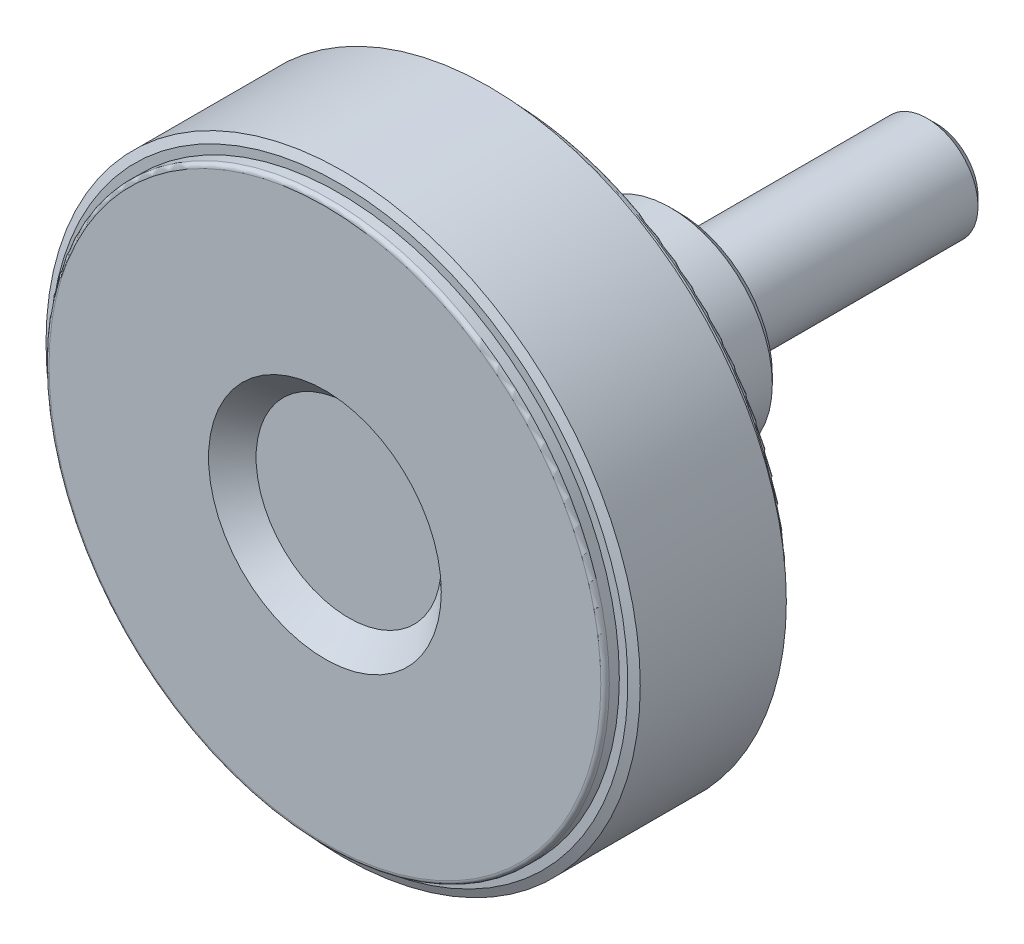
ISO-10303-21;
HEADER;
FILE_DESCRIPTION(('STEP AP214'),'2;1');
FILE_NAME('part.step','',(''),(''),'','','');
FILE_SCHEMA(('AUTOMOTIVE_DESIGN { 1 0 10303 214 1 1 1 1 }'));
ENDSEC;
DATA;
#1=APPLICATION_CONTEXT('core data for automotive mechanical design processes');
#2=APPLICATION_PROTOCOL_DEFINITION('international standard','automotive_design',2000,#1);
#3=PRODUCT_CONTEXT('',#1,'mechanical');
#4=PRODUCT('Part','Part','',(#3));
#5=PRODUCT_RELATED_PRODUCT_CATEGORY('part','',(#4));
#6=PRODUCT_DEFINITION_FORMATION('','',#4);
#7=PRODUCT_DEFINITION_CONTEXT('part definition',#1,'design');
#8=PRODUCT_DEFINITION('design','',#6,#7);
#9=PRODUCT_DEFINITION_SHAPE('','',#8);
#10=(LENGTH_UNIT() NAMED_UNIT(*) SI_UNIT(.MILLI.,.METRE.));
#11=(NAMED_UNIT(*) PLANE_ANGLE_UNIT() SI_UNIT($,.RADIAN.));
#12=(NAMED_UNIT(*) SI_UNIT($,.STERADIAN.) SOLID_ANGLE_UNIT());
#13=UNCERTAINTY_MEASURE_WITH_UNIT(LENGTH_MEASURE(1.E-05),#10,'distance_accuracy_value','');
#14=(GEOMETRIC_REPRESENTATION_CONTEXT(3) GLOBAL_UNCERTAINTY_ASSIGNED_CONTEXT((#13)) GLOBAL_UNIT_ASSIGNED_CONTEXT((#10,
#11,#12)) REPRESENTATION_CONTEXT('',''));
#15=CARTESIAN_POINT('',(0.,0.,0.));
#16=DIRECTION('',(0.,0.,1.));
#17=DIRECTION('',(1.,0.,0.));
#18=AXIS2_PLACEMENT_3D('',#15,#16,#17);
#19=CARTESIAN_POINT('',(0.,2.46325,-30.));
#20=DIRECTION('',(0.,0.,-1.));
#21=DIRECTION('',(-1.,0.,0.));
#22=AXIS2_PLACEMENT_3D('',#19,#20,#21);
#23=PLANE('',#22);
#24=CARTESIAN_POINT('',(0.,0.,-29.9999999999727));
#25=DIRECTION('',(0.,0.,1.));
#26=DIRECTION('',(1.,0.,0.));
#27=AXIS2_PLACEMENT_3D('',#24,#25,#26);
#28=CIRCLE('',#27,4.92650000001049);
#29=CARTESIAN_POINT('',(4.92650000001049,0.,-29.9999999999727));
#30=VERTEX_POINT('',#29);
#31=EDGE_CURVE('E179',#30,#30,#28,.T.);
#32=ORIENTED_EDGE('',*,*,#31,.F.);
#33=EDGE_LOOP('',(#32));
#34=FACE_BOUND('',#33,.T.);
#35=ADVANCED_FACE('F14',(#34),#23,.T.);
#36=CARTESIAN_POINT('',(0.,0.,-28.9265000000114));
#37=DIRECTION('',(0.,0.,1.));
#38=DIRECTION('',(1.,0.,0.));
#39=AXIS2_PLACEMENT_3D('',#36,#37,#38);
#40=CONICAL_SURFACE('',#39,5.99999999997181,0.785398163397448);
#41=ORIENTED_EDGE('',*,*,#31,.T.);
#42=EDGE_LOOP('',(#41));
#43=FACE_BOUND('',#42,.T.);
#44=CARTESIAN_POINT('',(0.,0.,-28.9265));
#45=DIRECTION('',(0.,0.,1.));
#46=DIRECTION('',(1.,0.,0.));
#47=AXIS2_PLACEMENT_3D('',#44,#45,#46);
#48=CIRCLE('',#47,6.);
#49=CARTESIAN_POINT('',(6.,0.,-28.9265));
#50=VERTEX_POINT('',#49);
#51=EDGE_CURVE('E176',#50,#50,#48,.T.);
#52=ORIENTED_EDGE('',*,*,#51,.F.);
#53=EDGE_LOOP('',(#52));
#54=FACE_BOUND('',#53,.T.);
#55=ADVANCED_FACE('F536',(#43,#54),#40,.T.);
#56=CARTESIAN_POINT('',(0.,0.,-13.96325));
#57=DIRECTION('',(0.,0.,1.));
#58=DIRECTION('',(1.,0.,0.));
#59=AXIS2_PLACEMENT_3D('',#56,#57,#58);
#60=CYLINDRICAL_SURFACE('',#59,6.);
#61=ORIENTED_EDGE('',*,*,#51,.T.);
#62=EDGE_LOOP('',(#61));
#63=FACE_BOUND('',#62,.T.);
#64=CARTESIAN_POINT('',(0.,0.,0.));
#65=DIRECTION('',(0.,0.,1.));
#66=DIRECTION('',(1.,0.,0.));
#67=AXIS2_PLACEMENT_3D('',#64,#65,#66);
#68=CIRCLE('',#67,6.);
#69=CARTESIAN_POINT('',(6.,0.,0.));
#70=VERTEX_POINT('',#69);
#71=EDGE_CURVE('E178',#70,#70,#68,.T.);
#72=ORIENTED_EDGE('',*,*,#71,.F.);
#73=EDGE_LOOP('',(#72));
#74=FACE_BOUND('',#73,.T.);
#75=ADVANCED_FACE('F526',(#63,#74),#60,.T.);
#76=CARTESIAN_POINT('',(0.,4.,0.));
#77=DIRECTION('',(0.,0.,-1.));
#78=DIRECTION('',(-1.,0.,0.));
#79=AXIS2_PLACEMENT_3D('',#76,#77,#78);
#80=PLANE('',#79);
#81=CARTESIAN_POINT('',(0.,0.,0.));
#82=DIRECTION('',(0.,0.,1.));
#83=DIRECTION('',(1.,0.,0.));
#84=AXIS2_PLACEMENT_3D('',#81,#82,#83);
#85=CIRCLE('',#84,8.);
#86=CARTESIAN_POINT('',(8.,0.,0.));
#87=VERTEX_POINT('',#86);
#88=EDGE_CURVE('E211',#87,#87,#85,.T.);
#89=ORIENTED_EDGE('',*,*,#88,.F.);
#90=EDGE_LOOP('',(#89));
#91=FACE_BOUND('',#90,.T.);
#92=ORIENTED_EDGE('',*,*,#71,.T.);
#93=EDGE_LOOP('',(#92));
#94=FACE_BOUND('',#93,.T.);
#95=ADVANCED_FACE('F516',(#91,#94),#80,.T.);
#96=CARTESIAN_POINT('',(0.,0.,0.15));
#97=DIRECTION('',(0.,0.,1.));
#98=DIRECTION('',(1.,0.,0.));
#99=AXIS2_PLACEMENT_3D('',#96,#97,#98);
#100=CYLINDRICAL_SURFACE('',#99,8.);
#101=ORIENTED_EDGE('',*,*,#88,.T.);
#102=EDGE_LOOP('',(#101));
#103=FACE_BOUND('',#102,.T.);
#104=CARTESIAN_POINT('',(0.,0.,0.3));
#105=DIRECTION('',(0.,0.,1.));
#106=DIRECTION('',(1.,0.,0.));
#107=AXIS2_PLACEMENT_3D('',#104,#105,#106);
#108=CIRCLE('',#107,8.);
#109=CARTESIAN_POINT('',(8.,0.,0.3));
#110=VERTEX_POINT('',#109);
#111=EDGE_CURVE('E208',#110,#110,#108,.T.);
#112=ORIENTED_EDGE('',*,*,#111,.F.);
#113=EDGE_LOOP('',(#112));
#114=FACE_BOUND('',#113,.T.);
#115=ADVANCED_FACE('F506',(#103,#114),#100,.T.);
#116=CARTESIAN_POINT('',(0.,9.5,0.3));
#117=DIRECTION('',(0.,0.,-1.));
#118=DIRECTION('',(-1.,0.,0.));
#119=AXIS2_PLACEMENT_3D('',#116,#117,#118);
#120=PLANE('',#119);
#121=CARTESIAN_POINT('',(0.,0.,0.3));
#122=DIRECTION('',(0.,0.,1.));
#123=DIRECTION('',(1.,0.,0.));
#124=AXIS2_PLACEMENT_3D('',#121,#122,#123);
#125=CIRCLE('',#124,11.);
#126=CARTESIAN_POINT('',(11.,0.,0.3));
#127=VERTEX_POINT('',#126);
#128=EDGE_CURVE('E175',#127,#127,#125,.T.);
#129=ORIENTED_EDGE('',*,*,#128,.F.);
#130=EDGE_LOOP('',(#129));
#131=FACE_BOUND('',#130,.T.);
#132=ORIENTED_EDGE('',*,*,#111,.T.);
#133=EDGE_LOOP('',(#132));
#134=FACE_BOUND('',#133,.T.);
#135=ADVANCED_FACE('F496',(#131,#134),#120,.T.);
#136=CARTESIAN_POINT('',(0.,0.,1.3));
#137=DIRECTION('',(0.,0.,1.));
#138=DIRECTION('',(1.,0.,0.));
#139=AXIS2_PLACEMENT_3D('',#136,#137,#138);
#140=CONICAL_SURFACE('',#139,12.,0.785398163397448);
#141=ORIENTED_EDGE('',*,*,#128,.T.);
#142=EDGE_LOOP('',(#141));
#143=FACE_BOUND('',#142,.T.);
#144=CARTESIAN_POINT('',(0.,0.,1.3));
#145=DIRECTION('',(0.,0.,1.));
#146=DIRECTION('',(1.,0.,0.));
#147=AXIS2_PLACEMENT_3D('',#144,#145,#146);
#148=CIRCLE('',#147,12.);
#149=CARTESIAN_POINT('',(12.,0.,1.3));
#150=VERTEX_POINT('',#149);
#151=EDGE_CURVE('E172',#150,#150,#148,.T.);
#152=ORIENTED_EDGE('',*,*,#151,.F.);
#153=EDGE_LOOP('',(#152));
#154=FACE_BOUND('',#153,.T.);
#155=ADVANCED_FACE('F487',(#143,#154),#140,.T.);
#156=CARTESIAN_POINT('',(0.,0.,17.65));
#157=DIRECTION('',(0.,0.,1.));
#158=DIRECTION('',(1.,0.,0.));
#159=AXIS2_PLACEMENT_3D('',#156,#157,#158);
#160=CYLINDRICAL_SURFACE('',#159,12.);
#161=ORIENTED_EDGE('',*,*,#151,.T.);
#162=EDGE_LOOP('',(#161));
#163=FACE_BOUND('',#162,.T.);
#164=CARTESIAN_POINT('',(0.,0.,34.));
#165=DIRECTION('',(0.,0.,-1.));
#166=DIRECTION('',(-1.,0.,0.));
#167=AXIS2_PLACEMENT_3D('',#164,#165,#166);
#168=CIRCLE('',#167,12.);
#169=CARTESIAN_POINT('',(-12.,0.,34.));
#170=VERTEX_POINT('',#169);
#171=EDGE_CURVE('E75',#170,#170,#168,.T.);
#172=ORIENTED_EDGE('',*,*,#171,.T.);
#173=EDGE_LOOP('',(#172));
#174=FACE_BOUND('',#173,.T.);
#175=ADVANCED_FACE('F482',(#163,#174),#160,.T.);
#176=CARTESIAN_POINT('',(0.,0.,34.));
#177=DIRECTION('',(0.,0.,-1.));
#178=DIRECTION('',(-1.,0.,0.));
#179=AXIS2_PLACEMENT_3D('',#176,#177,#178);
#180=TOROIDAL_SURFACE('',#179,13.,1.);
#181=CARTESIAN_POINT('',(0.,0.,35.));
#182=DIRECTION('',(0.,0.,-1.));
#183=DIRECTION('',(1.,0.,0.));
#184=AXIS2_PLACEMENT_3D('',#181,#182,#183);
#185=CIRCLE('',#184,13.);
#186=CARTESIAN_POINT('',(-13.,0.,35.));
#187=VERTEX_POINT('',#186);
#188=CARTESIAN_POINT('',(13.,0.,35.));
#189=VERTEX_POINT('',#188);
#190=EDGE_CURVE('E68',#187,#189,#185,.F.);
#191=ORIENTED_EDGE('',*,*,#190,.F.);
#192=CARTESIAN_POINT('',(0.,0.,35.));
#193=DIRECTION('',(0.,0.,-1.));
#194=DIRECTION('',(-1.,0.,0.));
#195=AXIS2_PLACEMENT_3D('',#192,#193,#194);
#196=CIRCLE('',#195,13.);
#197=CARTESIAN_POINT('',(0.,13.,35.));
#198=VERTEX_POINT('',#197);
#199=EDGE_CURVE('E71',#198,#187,#196,.F.);
#200=ORIENTED_EDGE('',*,*,#199,.F.);
#201=CARTESIAN_POINT('',(0.,0.,35.));
#202=DIRECTION('',(0.,0.,-1.));
#203=DIRECTION('',(0.,1.,0.));
#204=AXIS2_PLACEMENT_3D('',#201,#202,#203);
#205=CIRCLE('',#204,13.);
#206=EDGE_CURVE('E63',#189,#198,#205,.F.);
#207=ORIENTED_EDGE('',*,*,#206,.F.);
#208=EDGE_LOOP('',(#191,#200,#207));
#209=FACE_BOUND('',#208,.T.);
#210=ORIENTED_EDGE('',*,*,#171,.F.);
#211=EDGE_LOOP('',(#210));
#212=FACE_BOUND('',#211,.T.);
#213=ADVANCED_FACE('F66',(#209,#212),#180,.F.);
#214=CARTESIAN_POINT('',(0.,19.4615384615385,35.));
#215=DIRECTION('',(0.,0.,-1.));
#216=DIRECTION('',(-1.,0.,0.));
#217=AXIS2_PLACEMENT_3D('',#214,#215,#216);
#218=PLANE('',#217);
#219=CARTESIAN_POINT('',(0.,0.,35.));
#220=DIRECTION('',(0.,0.,1.));
#221=DIRECTION('',(-1.,0.,0.));
#222=AXIS2_PLACEMENT_3D('',#219,#220,#221);
#223=CIRCLE('',#222,25.9230769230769);
#224=CARTESIAN_POINT('',(25.9230769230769,0.,35.));
#225=VERTEX_POINT('',#224);
#226=CARTESIAN_POINT('',(-25.9230769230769,0.,35.));
#227=VERTEX_POINT('',#226);
#228=EDGE_CURVE('E81',#225,#227,#223,.F.);
#229=ORIENTED_EDGE('',*,*,#228,.T.);
#230=CARTESIAN_POINT('',(0.,0.,35.));
#231=DIRECTION('',(0.,0.,1.));
#232=DIRECTION('',(0.,1.,0.));
#233=AXIS2_PLACEMENT_3D('',#230,#231,#232);
#234=CIRCLE('',#233,25.9230769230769);
#235=CARTESIAN_POINT('',(0.,25.9230769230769,35.));
#236=VERTEX_POINT('',#235);
#237=EDGE_CURVE('E130',#227,#236,#234,.F.);
#238=ORIENTED_EDGE('',*,*,#237,.T.);
#239=CARTESIAN_POINT('',(0.,0.,35.));
#240=DIRECTION('',(0.,0.,1.));
#241=DIRECTION('',(1.,0.,0.));
#242=AXIS2_PLACEMENT_3D('',#239,#240,#241);
#243=CIRCLE('',#242,25.9230769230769);
#244=EDGE_CURVE('E143',#236,#225,#243,.F.);
#245=ORIENTED_EDGE('',*,*,#244,.T.);
#246=EDGE_LOOP('',(#229,#238,#245));
#247=FACE_BOUND('',#246,.T.);
#248=ORIENTED_EDGE('',*,*,#199,.T.);
#249=ORIENTED_EDGE('',*,*,#190,.T.);
#250=ORIENTED_EDGE('',*,*,#206,.T.);
#251=EDGE_LOOP('',(#248,#249,#250));
#252=FACE_BOUND('',#251,.T.);
#253=ADVANCED_FACE('F79',(#247,#252),#218,.T.);
#254=CARTESIAN_POINT('',(0.,0.,34.));
#255=DIRECTION('',(0.,0.,-1.));
#256=DIRECTION('',(-1.,0.,0.));
#257=AXIS2_PLACEMENT_3D('',#254,#255,#256);
#258=TOROIDAL_SURFACE('',#257,25.9230769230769,1.);
#259=ORIENTED_EDGE('',*,*,#237,.F.);
#260=ORIENTED_EDGE('',*,*,#228,.F.);
#261=ORIENTED_EDGE('',*,*,#244,.F.);
#262=EDGE_LOOP('',(#259,#260,#261));
#263=FACE_BOUND('',#262,.T.);
#264=CARTESIAN_POINT('',(0.,0.,34.));
#265=DIRECTION('',(0.,0.,1.));
#266=DIRECTION('',(1.,0.,0.));
#267=AXIS2_PLACEMENT_3D('',#264,#265,#266);
#268=CIRCLE('',#267,26.9230769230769);
#269=CARTESIAN_POINT('',(26.9230769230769,0.,34.));
#270=VERTEX_POINT('',#269);
#271=EDGE_CURVE('E205',#270,#270,#268,.F.);
#272=ORIENTED_EDGE('',*,*,#271,.T.);
#273=EDGE_LOOP('',(#272));
#274=FACE_BOUND('',#273,.T.);
#275=ADVANCED_FACE('F100',(#263,#274),#258,.F.);
#276=CARTESIAN_POINT('',(0.,0.,27.25));
#277=DIRECTION('',(0.,0.,1.));
#278=DIRECTION('',(1.,0.,0.));
#279=AXIS2_PLACEMENT_3D('',#276,#277,#278);
#280=CYLINDRICAL_SURFACE('',#279,26.9230769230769);
#281=ORIENTED_EDGE('',*,*,#271,.F.);
#282=EDGE_LOOP('',(#281));
#283=FACE_BOUND('',#282,.T.);
#284=CARTESIAN_POINT('',(0.,0.,20.5));
#285=DIRECTION('',(0.,0.,1.));
#286=DIRECTION('',(1.,0.,0.));
#287=AXIS2_PLACEMENT_3D('',#284,#285,#286);
#288=CIRCLE('',#287,26.9230769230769);
#289=CARTESIAN_POINT('',(26.9230769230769,0.,20.5));
#290=VERTEX_POINT('',#289);
#291=EDGE_CURVE('E201',#290,#290,#288,.T.);
#292=ORIENTED_EDGE('',*,*,#291,.F.);
#293=EDGE_LOOP('',(#292));
#294=FACE_BOUND('',#293,.T.);
#295=ADVANCED_FACE('F329',(#283,#294),#280,.F.);
#296=CARTESIAN_POINT('',(0.,29.7115384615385,20.5));
#297=DIRECTION('',(0.,0.,-1.));
#298=DIRECTION('',(-1.,0.,0.));
#299=AXIS2_PLACEMENT_3D('',#296,#297,#298);
#300=PLANE('',#299);
#301=CARTESIAN_POINT('',(0.,0.,20.5));
#302=DIRECTION('',(0.,0.,1.));
#303=DIRECTION('',(-1.,0.,0.));
#304=AXIS2_PLACEMENT_3D('',#301,#302,#303);
#305=CIRCLE('',#304,32.5);
#306=CARTESIAN_POINT('',(-32.5,0.,20.5));
#307=VERTEX_POINT('',#306);
#308=CARTESIAN_POINT('',(32.5,0.,20.5));
#309=VERTEX_POINT('',#308);
#310=EDGE_CURVE('E264',#307,#309,#305,.T.);
#311=ORIENTED_EDGE('',*,*,#310,.F.);
#312=CARTESIAN_POINT('',(0.,0.,20.5));
#313=DIRECTION('',(0.,0.,1.));
#314=DIRECTION('',(0.,1.,0.));
#315=AXIS2_PLACEMENT_3D('',#312,#313,#314);
#316=CIRCLE('',#315,32.5);
#317=CARTESIAN_POINT('',(0.,32.5,20.5));
#318=VERTEX_POINT('',#317);
#319=EDGE_CURVE('E299',#318,#307,#316,.T.);
#320=ORIENTED_EDGE('',*,*,#319,.F.);
#321=CARTESIAN_POINT('',(0.,0.,20.5));
#322=DIRECTION('',(0.,0.,1.));
#323=DIRECTION('',(1.,0.,0.));
#324=AXIS2_PLACEMENT_3D('',#321,#322,#323);
#325=CIRCLE('',#324,32.5);
#326=EDGE_CURVE('E204',#309,#318,#325,.T.);
#327=ORIENTED_EDGE('',*,*,#326,.F.);
#328=EDGE_LOOP('',(#311,#320,#327));
#329=FACE_BOUND('',#328,.T.);
#330=ORIENTED_EDGE('',*,*,#291,.T.);
#331=EDGE_LOOP('',(#330));
#332=FACE_BOUND('',#331,.T.);
#333=ADVANCED_FACE('F275',(#329,#332),#300,.T.);
#334=CARTESIAN_POINT('',(0.,0.,21.));
#335=DIRECTION('',(0.,0.,-1.));
#336=DIRECTION('',(-1.,0.,0.));
#337=AXIS2_PLACEMENT_3D('',#334,#335,#336);
#338=TOROIDAL_SURFACE('',#337,32.5,0.5);
#339=ORIENTED_EDGE('',*,*,#319,.T.);
#340=ORIENTED_EDGE('',*,*,#310,.T.);
#341=ORIENTED_EDGE('',*,*,#326,.T.);
#342=EDGE_LOOP('',(#339,#340,#341));
#343=FACE_BOUND('',#342,.T.);
#344=CARTESIAN_POINT('',(0.,0.,21.));
#345=DIRECTION('',(0.,0.,1.));
#346=DIRECTION('',(1.,0.,0.));
#347=AXIS2_PLACEMENT_3D('',#344,#345,#346);
#348=CIRCLE('',#347,33.);
#349=CARTESIAN_POINT('',(33.,0.,21.));
#350=VERTEX_POINT('',#349);
#351=EDGE_CURVE('E200',#350,#350,#348,.T.);
#352=ORIENTED_EDGE('',*,*,#351,.F.);
#353=EDGE_LOOP('',(#352));
#354=FACE_BOUND('',#353,.T.);
#355=ADVANCED_FACE('F269',(#343,#354),#338,.T.);
#356=CARTESIAN_POINT('',(0.,0.,21.59));
#357=DIRECTION('',(0.,0.,1.));
#358=DIRECTION('',(1.,0.,0.));
#359=AXIS2_PLACEMENT_3D('',#356,#357,#358);
#360=CYLINDRICAL_SURFACE('',#359,33.);
#361=ORIENTED_EDGE('',*,*,#351,.T.);
#362=EDGE_LOOP('',(#361));
#363=FACE_BOUND('',#362,.T.);
#364=CARTESIAN_POINT('',(0.,0.,22.18));
#365=DIRECTION('',(0.,0.,1.));
#366=DIRECTION('',(1.,0.,0.));
#367=AXIS2_PLACEMENT_3D('',#364,#365,#366);
#368=CIRCLE('',#367,33.);
#369=CARTESIAN_POINT('',(33.,0.,22.18));
#370=VERTEX_POINT('',#369);
#371=EDGE_CURVE('E197',#370,#370,#368,.T.);
#372=ORIENTED_EDGE('',*,*,#371,.F.);
#373=EDGE_LOOP('',(#372));
#374=FACE_BOUND('',#373,.T.);
#375=ADVANCED_FACE('F274',(#363,#374),#360,.T.);
#376=CARTESIAN_POINT('',(0.,33.5,22.18));
#377=DIRECTION('',(0.,0.,-1.));
#378=DIRECTION('',(-1.,0.,0.));
#379=AXIS2_PLACEMENT_3D('',#376,#377,#378);
#380=PLANE('',#379);
#381=CARTESIAN_POINT('',(0.,0.,22.18));
#382=DIRECTION('',(0.,0.,1.));
#383=DIRECTION('',(1.,0.,0.));
#384=AXIS2_PLACEMENT_3D('',#381,#382,#383);
#385=CIRCLE('',#384,34.);
#386=CARTESIAN_POINT('',(34.,0.,22.18));
#387=VERTEX_POINT('',#386);
#388=EDGE_CURVE('E193',#387,#387,#385,.T.);
#389=ORIENTED_EDGE('',*,*,#388,.F.);
#390=EDGE_LOOP('',(#389));
#391=FACE_BOUND('',#390,.T.);
#392=ORIENTED_EDGE('',*,*,#371,.T.);
#393=EDGE_LOOP('',(#392));
#394=FACE_BOUND('',#393,.T.);
#395=ADVANCED_FACE('F342',(#391,#394),#380,.T.);
#396=CARTESIAN_POINT('',(0.,0.,22.646307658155));
#397=DIRECTION('',(0.,0.,1.));
#398=DIRECTION('',(1.,0.,0.));
#399=AXIS2_PLACEMENT_3D('',#396,#397,#398);
#400=CONICAL_SURFACE('',#399,35.,1.13446401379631);
#401=CARTESIAN_POINT('',(0.,2.67164068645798E-12,22.646307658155));
#402=DIRECTION('',(0.,0.,-1.));
#403=DIRECTION('',(-1.,0.,0.));
#404=AXIS2_PLACEMENT_3D('',#401,#402,#403);
#405=CIRCLE('',#404,34.9999999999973);
#406=CARTESIAN_POINT('',(-34.9999999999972,2.67164068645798E-12,22.646307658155));
#407=VERTEX_POINT('',#406);
#408=EDGE_CURVE('E196',#407,#407,#405,.F.);
#409=ORIENTED_EDGE('',*,*,#408,.F.);
#410=EDGE_LOOP('',(#409));
#411=FACE_BOUND('',#410,.T.);
#412=ORIENTED_EDGE('',*,*,#388,.T.);
#413=EDGE_LOOP('',(#412));
#414=FACE_BOUND('',#413,.T.);
#415=ADVANCED_FACE('F340',(#411,#414),#400,.T.);
#416=CARTESIAN_POINT('',(0.,5.45454545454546,39.2));
#417=DIRECTION('',(0.,0.,1.));
#418=DIRECTION('',(1.,0.,0.));
#419=AXIS2_PLACEMENT_3D('',#416,#417,#418);
#420=PLANE('',#419);
#421=CARTESIAN_POINT('',(0.,0.,39.2));
#422=DIRECTION('',(0.,0.,1.));
#423=DIRECTION('',(1.,0.,0.));
#424=AXIS2_PLACEMENT_3D('',#421,#422,#423);
#425=CIRCLE('',#424,10.9090909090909);
#426=CARTESIAN_POINT('',(10.9090909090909,0.,39.2));
#427=VERTEX_POINT('',#426);
#428=EDGE_CURVE('E181',#427,#427,#425,.T.);
#429=ORIENTED_EDGE('',*,*,#428,.T.);
#430=EDGE_LOOP('',(#429));
#431=FACE_BOUND('',#430,.T.);
#432=ADVANCED_FACE('F242',(#431),#420,.T.);
#433=CARTESIAN_POINT('',(0.,0.,42.));
#434=DIRECTION('',(0.,0.,1.));
#435=DIRECTION('',(1.,0.,0.));
#436=AXIS2_PLACEMENT_3D('',#433,#434,#435);
#437=CONICAL_SURFACE('',#436,13.7090909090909,0.785398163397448);
#438=CARTESIAN_POINT('',(0.,0.,42.));
#439=DIRECTION('',(0.,0.,1.));
#440=DIRECTION('',(1.,0.,0.));
#441=AXIS2_PLACEMENT_3D('',#438,#439,#440);
#442=CIRCLE('',#441,13.7090909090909);
#443=CARTESIAN_POINT('',(13.7090909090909,0.,42.));
#444=VERTEX_POINT('',#443);
#445=EDGE_CURVE('E9',#444,#444,#442,.F.);
#446=ORIENTED_EDGE('',*,*,#445,.F.);
#447=EDGE_LOOP('',(#446));
#448=FACE_BOUND('',#447,.T.);
#449=ORIENTED_EDGE('',*,*,#428,.F.);
#450=EDGE_LOOP('',(#449));
#451=FACE_BOUND('',#450,.T.);
#452=ADVANCED_FACE('F240',(#448,#451),#437,.F.);
#453=CARTESIAN_POINT('',(0.,23.1045454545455,42.));
#454=DIRECTION('',(0.,0.,1.));
#455=DIRECTION('',(1.,0.,0.));
#456=AXIS2_PLACEMENT_3D('',#453,#454,#455);
#457=PLANE('',#456);
#458=ORIENTED_EDGE('',*,*,#445,.T.);
#459=EDGE_LOOP('',(#458));
#460=FACE_BOUND('',#459,.T.);
#461=CARTESIAN_POINT('',(0.,0.,42.));
#462=DIRECTION('',(0.,0.,-1.));
#463=DIRECTION('',(-1.,0.,0.));
#464=AXIS2_PLACEMENT_3D('',#461,#462,#463);
#465=CIRCLE('',#464,32.5);
#466=CARTESIAN_POINT('',(0.,32.5,42.));
#467=VERTEX_POINT('',#466);
#468=CARTESIAN_POINT('',(-32.5,0.,42.));
#469=VERTEX_POINT('',#468);
#470=EDGE_CURVE('E219',#467,#469,#465,.F.);
#471=ORIENTED_EDGE('',*,*,#470,.T.);
#472=CARTESIAN_POINT('',(0.,0.,42.));
#473=DIRECTION('',(0.,0.,-1.));
#474=DIRECTION('',(1.,0.,0.));
#475=AXIS2_PLACEMENT_3D('',#472,#473,#474);
#476=CIRCLE('',#475,32.5);
#477=CARTESIAN_POINT('',(32.5,0.,42.));
#478=VERTEX_POINT('',#477);
#479=EDGE_CURVE('E23',#469,#478,#476,.F.);
#480=ORIENTED_EDGE('',*,*,#479,.T.);
#481=CARTESIAN_POINT('',(0.,0.,42.));
#482=DIRECTION('',(0.,0.,-1.));
#483=DIRECTION('',(0.,1.,0.));
#484=AXIS2_PLACEMENT_3D('',#481,#482,#483);
#485=CIRCLE('',#484,32.5);
#486=EDGE_CURVE('E184',#478,#467,#485,.F.);
#487=ORIENTED_EDGE('',*,*,#486,.T.);
#488=EDGE_LOOP('',(#471,#480,#487));
#489=FACE_BOUND('',#488,.T.);
#490=ADVANCED_FACE('F238',(#460,#489),#457,.T.);
#491=CARTESIAN_POINT('',(0.,0.,41.5));
#492=DIRECTION('',(0.,0.,-1.));
#493=DIRECTION('',(-1.,0.,0.));
#494=AXIS2_PLACEMENT_3D('',#491,#492,#493);
#495=TOROIDAL_SURFACE('',#494,32.5,0.499999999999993);
#496=CARTESIAN_POINT('',(0.,0.,41.5));
#497=DIRECTION('',(0.,0.,-1.));
#498=DIRECTION('',(-1.,0.,0.));
#499=AXIS2_PLACEMENT_3D('',#496,#497,#498);
#500=CIRCLE('',#499,33.);
#501=CARTESIAN_POINT('',(-33.,0.,41.5));
#502=VERTEX_POINT('',#501);
#503=EDGE_CURVE('E185',#502,#502,#500,.F.);
#504=ORIENTED_EDGE('',*,*,#503,.T.);
#505=EDGE_LOOP('',(#504));
#506=FACE_BOUND('',#505,.T.);
#507=ORIENTED_EDGE('',*,*,#479,.F.);
#508=ORIENTED_EDGE('',*,*,#470,.F.);
#509=ORIENTED_EDGE('',*,*,#486,.F.);
#510=EDGE_LOOP('',(#507,#508,#509));
#511=FACE_BOUND('',#510,.T.);
#512=ADVANCED_FACE('F226',(#506,#511),#495,.T.);
#513=CARTESIAN_POINT('',(0.,0.,40.91));
#514=DIRECTION('',(0.,0.,1.));
#515=DIRECTION('',(1.,0.,0.));
#516=AXIS2_PLACEMENT_3D('',#513,#514,#515);
#517=CYLINDRICAL_SURFACE('',#516,33.);
#518=ORIENTED_EDGE('',*,*,#503,.F.);
#519=EDGE_LOOP('',(#518));
#520=FACE_BOUND('',#519,.T.);
#521=CARTESIAN_POINT('',(0.,0.,40.32));
#522=DIRECTION('',(0.,0.,1.));
#523=DIRECTION('',(1.,0.,0.));
#524=AXIS2_PLACEMENT_3D('',#521,#522,#523);
#525=CIRCLE('',#524,33.);
#526=CARTESIAN_POINT('',(33.,0.,40.32));
#527=VERTEX_POINT('',#526);
#528=EDGE_CURVE('E186',#527,#527,#525,.T.);
#529=ORIENTED_EDGE('',*,*,#528,.T.);
#530=EDGE_LOOP('',(#529));
#531=FACE_BOUND('',#530,.T.);
#532=ADVANCED_FACE('F237',(#520,#531),#517,.T.);
#533=CARTESIAN_POINT('',(0.,0.,39.853692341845));
#534=DIRECTION('',(0.,0.,-1.));
#535=DIRECTION('',(-1.,0.,0.));
#536=AXIS2_PLACEMENT_3D('',#533,#534,#535);
#537=CONICAL_SURFACE('',#536,35.,1.13446401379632);
#538=CARTESIAN_POINT('',(0.,0.,40.32));
#539=DIRECTION('',(0.,0.,-1.));
#540=DIRECTION('',(-1.,0.,0.));
#541=AXIS2_PLACEMENT_3D('',#538,#539,#540);
#542=CIRCLE('',#541,34.);
#543=CARTESIAN_POINT('',(-34.,0.,40.32));
#544=VERTEX_POINT('',#543);
#545=EDGE_CURVE('E189',#544,#544,#542,.F.);
#546=ORIENTED_EDGE('',*,*,#545,.F.);
#547=EDGE_LOOP('',(#546));
#548=FACE_BOUND('',#547,.T.);
#549=CARTESIAN_POINT('',(0.,0.,39.853692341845));
#550=DIRECTION('',(0.,0.,-1.));
#551=DIRECTION('',(0.,1.,0.));
#552=AXIS2_PLACEMENT_3D('',#549,#550,#551);
#553=CIRCLE('',#552,35.);
#554=CARTESIAN_POINT('',(0.,35.,39.853692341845));
#555=VERTEX_POINT('',#554);
#556=EDGE_CURVE('E192',#555,#555,#553,.F.);
#557=ORIENTED_EDGE('',*,*,#556,.T.);
#558=EDGE_LOOP('',(#557));
#559=FACE_BOUND('',#558,.T.);
#560=ADVANCED_FACE('F360',(#548,#559),#537,.T.);
#561=CARTESIAN_POINT('',(0.,33.5,40.32));
#562=DIRECTION('',(0.,0.,1.));
#563=DIRECTION('',(1.,0.,0.));
#564=AXIS2_PLACEMENT_3D('',#561,#562,#563);
#565=PLANE('',#564);
#566=ORIENTED_EDGE('',*,*,#528,.F.);
#567=EDGE_LOOP('',(#566));
#568=FACE_BOUND('',#567,.T.);
#569=ORIENTED_EDGE('',*,*,#545,.T.);
#570=EDGE_LOOP('',(#569));
#571=FACE_BOUND('',#570,.T.);
#572=ADVANCED_FACE('F358',(#568,#571),#565,.T.);
#573=CARTESIAN_POINT('',(0.,2.67164068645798E-12,0.));
#574=DIRECTION('',(0.,0.,-1.));
#575=DIRECTION('',(-1.,0.,0.));
#576=AXIS2_PLACEMENT_3D('',#573,#574,#575);
#577=CYLINDRICAL_SURFACE('',#576,34.9999999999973);
#578=ORIENTED_EDGE('',*,*,#408,.T.);
#579=EDGE_LOOP('',(#578));
#580=FACE_BOUND('',#579,.T.);
#581=ORIENTED_EDGE('',*,*,#556,.F.);
#582=EDGE_LOOP('',(#581));
#583=FACE_BOUND('',#582,.T.);
#584=ADVANCED_FACE('F355',(#580,#583),#577,.T.);
#585=CLOSED_SHELL('',(#35,#55,#75,#95,#115,#135,#155,#175,#213,#253,#275,#295,#333,#355,#375,
#395,#415,#432,#452,#490,#512,#532,#560,#572,#584));
#586=MANIFOLD_SOLID_BREP('B1',#585);
#587=ADVANCED_BREP_SHAPE_REPRESENTATION('',(#18,#586),#14);
#588=SHAPE_DEFINITION_REPRESENTATION(#9,#587);
ENDSEC;
END-ISO-10303-21;
